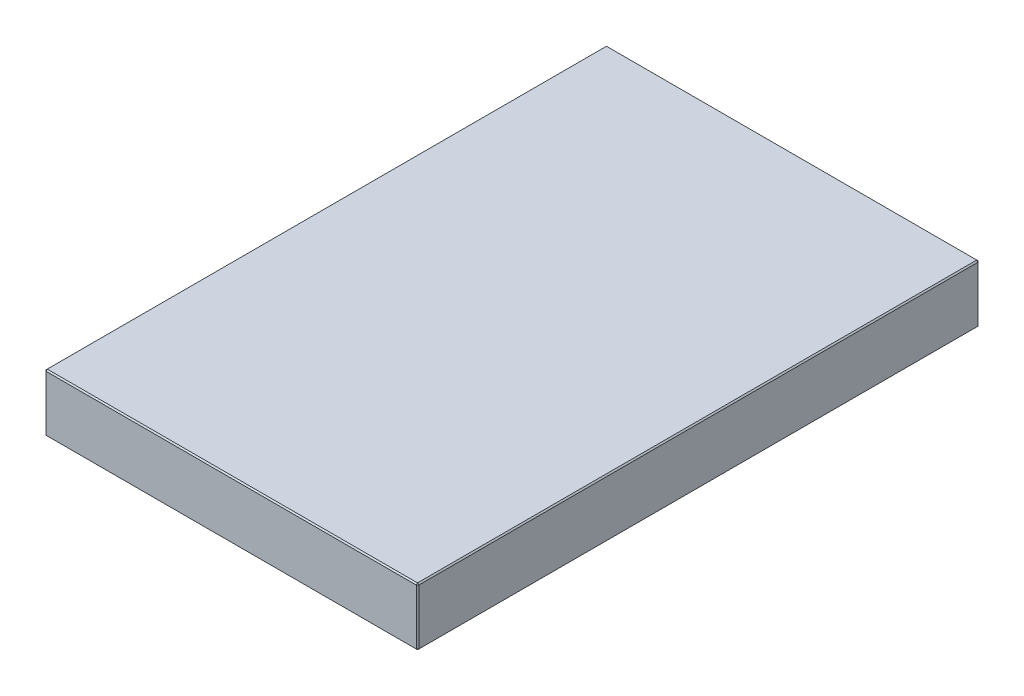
ISO-10303-21;
HEADER;
FILE_DESCRIPTION(('STEP AP214'),'2;1');
FILE_NAME('part.step','',(''),(''),'','','');
FILE_SCHEMA(('AUTOMOTIVE_DESIGN { 1 0 10303 214 1 1 1 1 }'));
ENDSEC;
DATA;
#1=APPLICATION_CONTEXT('core data for automotive mechanical design processes');
#2=APPLICATION_PROTOCOL_DEFINITION('international standard','automotive_design',2000,#1);
#3=PRODUCT_CONTEXT('',#1,'mechanical');
#4=PRODUCT('Part','Part','',(#3));
#5=PRODUCT_RELATED_PRODUCT_CATEGORY('part','',(#4));
#6=PRODUCT_DEFINITION_FORMATION('','',#4);
#7=PRODUCT_DEFINITION_CONTEXT('part definition',#1,'design');
#8=PRODUCT_DEFINITION('design','',#6,#7);
#9=PRODUCT_DEFINITION_SHAPE('','',#8);
#10=(LENGTH_UNIT() NAMED_UNIT(*) SI_UNIT(.MILLI.,.METRE.));
#11=(NAMED_UNIT(*) PLANE_ANGLE_UNIT() SI_UNIT($,.RADIAN.));
#12=(NAMED_UNIT(*) SI_UNIT($,.STERADIAN.) SOLID_ANGLE_UNIT());
#13=UNCERTAINTY_MEASURE_WITH_UNIT(LENGTH_MEASURE(1.E-05),#10,'distance_accuracy_value','');
#14=(GEOMETRIC_REPRESENTATION_CONTEXT(3) GLOBAL_UNCERTAINTY_ASSIGNED_CONTEXT((#13)) GLOBAL_UNIT_ASSIGNED_CONTEXT((#10,
#11,#12)) REPRESENTATION_CONTEXT('',''));
#15=CARTESIAN_POINT('',(0.,0.,0.));
#16=DIRECTION('',(0.,0.,1.));
#17=DIRECTION('',(1.,0.,0.));
#18=AXIS2_PLACEMENT_3D('',#15,#16,#17);
#19=CARTESIAN_POINT('',(-148.,46.,223.));
#20=DIRECTION('',(1.,0.,0.));
#21=DIRECTION('',(0.,0.,-1.));
#22=AXIS2_PLACEMENT_3D('',#19,#20,#21);
#23=PLANE('',#22);
#24=DIRECTION('',(0.,-1.,0.));
#25=VECTOR('',#24,1.);
#26=CARTESIAN_POINT('',(-148.,46.,-222.));
#27=LINE('',#26,#25);
#28=CARTESIAN_POINT('',(-148.,45.,-222.));
#29=VERTEX_POINT('',#28);
#30=CARTESIAN_POINT('',(-148.,1.,-222.));
#31=VERTEX_POINT('',#30);
#32=EDGE_CURVE('E114',#29,#31,#27,.T.);
#33=ORIENTED_EDGE('',*,*,#32,.T.);
#34=DIRECTION('',(0.,0.,1.));
#35=VECTOR('',#34,1.);
#36=CARTESIAN_POINT('',(-148.,1.,223.));
#37=LINE('',#36,#35);
#38=CARTESIAN_POINT('',(-148.,1.,222.));
#39=VERTEX_POINT('',#38);
#40=EDGE_CURVE('E110',#31,#39,#37,.T.);
#41=ORIENTED_EDGE('',*,*,#40,.T.);
#42=DIRECTION('',(0.,1.,0.));
#43=VECTOR('',#42,1.);
#44=CARTESIAN_POINT('',(-148.,46.,222.));
#45=LINE('',#44,#43);
#46=CARTESIAN_POINT('',(-148.,45.,222.));
#47=VERTEX_POINT('',#46);
#48=EDGE_CURVE('E103',#39,#47,#45,.T.);
#49=ORIENTED_EDGE('',*,*,#48,.T.);
#50=DIRECTION('',(0.,0.,-1.));
#51=VECTOR('',#50,1.);
#52=CARTESIAN_POINT('',(-148.,45.,-223.));
#53=LINE('',#52,#51);
#54=EDGE_CURVE('E107',#47,#29,#53,.T.);
#55=ORIENTED_EDGE('',*,*,#54,.T.);
#56=EDGE_LOOP('',(#33,#41,#49,#55));
#57=FACE_BOUND('',#56,.T.);
#58=ADVANCED_FACE('F15',(#57),#23,.F.);
#59=CARTESIAN_POINT('',(148.,46.,223.));
#60=DIRECTION('',(0.,0.,-1.));
#61=DIRECTION('',(-1.,0.,0.));
#62=AXIS2_PLACEMENT_3D('',#59,#60,#61);
#63=PLANE('',#62);
#64=DIRECTION('',(-1.,0.,0.));
#65=VECTOR('',#64,1.);
#66=CARTESIAN_POINT('',(-148.,45.,223.));
#67=LINE('',#66,#65);
#68=CARTESIAN_POINT('',(147.,45.,223.));
#69=VERTEX_POINT('',#68);
#70=CARTESIAN_POINT('',(-147.,45.,223.));
#71=VERTEX_POINT('',#70);
#72=EDGE_CURVE('E164',#69,#71,#67,.T.);
#73=ORIENTED_EDGE('',*,*,#72,.T.);
#74=DIRECTION('',(0.,-1.,0.));
#75=VECTOR('',#74,1.);
#76=CARTESIAN_POINT('',(-147.,46.,223.));
#77=LINE('',#76,#75);
#78=CARTESIAN_POINT('',(-147.,0.999999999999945,223.));
#79=VERTEX_POINT('',#78);
#80=EDGE_CURVE('E122',#71,#79,#77,.T.);
#81=ORIENTED_EDGE('',*,*,#80,.T.);
#82=DIRECTION('',(1.,0.,0.));
#83=VECTOR('',#82,1.);
#84=CARTESIAN_POINT('',(148.,0.999999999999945,223.));
#85=LINE('',#84,#83);
#86=CARTESIAN_POINT('',(147.,0.999999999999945,223.));
#87=VERTEX_POINT('',#86);
#88=EDGE_CURVE('E168',#79,#87,#85,.T.);
#89=ORIENTED_EDGE('',*,*,#88,.T.);
#90=DIRECTION('',(0.,1.,0.));
#91=VECTOR('',#90,1.);
#92=CARTESIAN_POINT('',(147.,46.,223.));
#93=LINE('',#92,#91);
#94=EDGE_CURVE('E166',#87,#69,#93,.T.);
#95=ORIENTED_EDGE('',*,*,#94,.T.);
#96=EDGE_LOOP('',(#73,#81,#89,#95));
#97=FACE_BOUND('',#96,.T.);
#98=ADVANCED_FACE('F275',(#97),#63,.F.);
#99=CARTESIAN_POINT('',(148.,46.,223.));
#100=DIRECTION('',(-1.,0.,0.));
#101=DIRECTION('',(0.,0.,1.));
#102=AXIS2_PLACEMENT_3D('',#99,#100,#101);
#103=PLANE('',#102);
#104=DIRECTION('',(0.,0.,-1.));
#105=VECTOR('',#104,1.);
#106=CARTESIAN_POINT('',(148.,0.999999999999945,223.));
#107=LINE('',#106,#105);
#108=CARTESIAN_POINT('',(148.,0.999999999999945,222.));
#109=VERTEX_POINT('',#108);
#110=CARTESIAN_POINT('',(148.,0.999999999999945,-222.));
#111=VERTEX_POINT('',#110);
#112=EDGE_CURVE('E159',#109,#111,#107,.T.);
#113=ORIENTED_EDGE('',*,*,#112,.T.);
#114=DIRECTION('',(0.,1.,0.));
#115=VECTOR('',#114,1.);
#116=CARTESIAN_POINT('',(148.,46.,-222.));
#117=LINE('',#116,#115);
#118=CARTESIAN_POINT('',(148.,45.,-222.));
#119=VERTEX_POINT('',#118);
#120=EDGE_CURVE('E161',#111,#119,#117,.T.);
#121=ORIENTED_EDGE('',*,*,#120,.T.);
#122=DIRECTION('',(0.,0.,1.));
#123=VECTOR('',#122,1.);
#124=CARTESIAN_POINT('',(148.,45.,223.));
#125=LINE('',#124,#123);
#126=CARTESIAN_POINT('',(148.,45.,222.));
#127=VERTEX_POINT('',#126);
#128=EDGE_CURVE('E155',#119,#127,#125,.T.);
#129=ORIENTED_EDGE('',*,*,#128,.T.);
#130=DIRECTION('',(0.,-1.,0.));
#131=VECTOR('',#130,1.);
#132=CARTESIAN_POINT('',(148.,46.,222.));
#133=LINE('',#132,#131);
#134=EDGE_CURVE('E157',#127,#109,#133,.T.);
#135=ORIENTED_EDGE('',*,*,#134,.T.);
#136=EDGE_LOOP('',(#113,#121,#129,#135));
#137=FACE_BOUND('',#136,.T.);
#138=ADVANCED_FACE('F254',(#137),#103,.F.);
#139=CARTESIAN_POINT('',(148.,46.,-223.));
#140=DIRECTION('',(0.,0.,1.));
#141=DIRECTION('',(1.,0.,0.));
#142=AXIS2_PLACEMENT_3D('',#139,#140,#141);
#143=PLANE('',#142);
#144=DIRECTION('',(0.,-1.,0.));
#145=VECTOR('',#144,1.);
#146=CARTESIAN_POINT('',(147.,46.,-223.));
#147=LINE('',#146,#145);
#148=CARTESIAN_POINT('',(147.,45.,-223.));
#149=VERTEX_POINT('',#148);
#150=CARTESIAN_POINT('',(147.,0.999999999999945,-223.));
#151=VERTEX_POINT('',#150);
#152=EDGE_CURVE('E148',#149,#151,#147,.T.);
#153=ORIENTED_EDGE('',*,*,#152,.T.);
#154=DIRECTION('',(-1.,0.,0.));
#155=VECTOR('',#154,1.);
#156=CARTESIAN_POINT('',(148.,0.999999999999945,-223.));
#157=LINE('',#156,#155);
#158=CARTESIAN_POINT('',(-147.,0.999999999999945,-223.));
#159=VERTEX_POINT('',#158);
#160=EDGE_CURVE('E153',#151,#159,#157,.T.);
#161=ORIENTED_EDGE('',*,*,#160,.T.);
#162=DIRECTION('',(0.,1.,0.));
#163=VECTOR('',#162,1.);
#164=CARTESIAN_POINT('',(-147.,46.,-223.));
#165=LINE('',#164,#163);
#166=CARTESIAN_POINT('',(-147.,45.,-223.));
#167=VERTEX_POINT('',#166);
#168=EDGE_CURVE('E150',#159,#167,#165,.T.);
#169=ORIENTED_EDGE('',*,*,#168,.T.);
#170=DIRECTION('',(1.,0.,0.));
#171=VECTOR('',#170,1.);
#172=CARTESIAN_POINT('',(148.,45.,-223.));
#173=LINE('',#172,#171);
#174=EDGE_CURVE('E146',#167,#149,#173,.T.);
#175=ORIENTED_EDGE('',*,*,#174,.T.);
#176=EDGE_LOOP('',(#153,#161,#169,#175));
#177=FACE_BOUND('',#176,.T.);
#178=ADVANCED_FACE('F284',(#177),#143,.F.);
#179=CARTESIAN_POINT('',(0.,46.,0.));
#180=DIRECTION('',(0.,1.,0.));
#181=DIRECTION('',(0.,0.,1.));
#182=AXIS2_PLACEMENT_3D('',#179,#180,#181);
#183=PLANE('',#182);
#184=DIRECTION('',(0.,0.,-1.));
#185=VECTOR('',#184,1.);
#186=CARTESIAN_POINT('',(147.,46.,-223.));
#187=LINE('',#186,#185);
#188=CARTESIAN_POINT('',(147.,46.,222.));
#189=VERTEX_POINT('',#188);
#190=CARTESIAN_POINT('',(147.,46.,-222.));
#191=VERTEX_POINT('',#190);
#192=EDGE_CURVE('E24',#189,#191,#187,.T.);
#193=ORIENTED_EDGE('',*,*,#192,.T.);
#194=DIRECTION('',(-1.,0.,0.));
#195=VECTOR('',#194,1.);
#196=CARTESIAN_POINT('',(-148.,46.,-222.));
#197=LINE('',#196,#195);
#198=CARTESIAN_POINT('',(-147.,46.,-222.));
#199=VERTEX_POINT('',#198);
#200=EDGE_CURVE('E9',#191,#199,#197,.T.);
#201=ORIENTED_EDGE('',*,*,#200,.T.);
#202=DIRECTION('',(0.,0.,1.));
#203=VECTOR('',#202,1.);
#204=CARTESIAN_POINT('',(-147.,46.,223.));
#205=LINE('',#204,#203);
#206=CARTESIAN_POINT('',(-147.,46.,222.));
#207=VERTEX_POINT('',#206);
#208=EDGE_CURVE('E180',#199,#207,#205,.T.);
#209=ORIENTED_EDGE('',*,*,#208,.T.);
#210=DIRECTION('',(1.,0.,0.));
#211=VECTOR('',#210,1.);
#212=CARTESIAN_POINT('',(148.,46.,222.));
#213=LINE('',#212,#211);
#214=EDGE_CURVE('E35',#207,#189,#213,.T.);
#215=ORIENTED_EDGE('',*,*,#214,.T.);
#216=EDGE_LOOP('',(#193,#201,#209,#215));
#217=FACE_BOUND('',#216,.T.);
#218=ADVANCED_FACE('F350',(#217),#183,.T.);
#219=CARTESIAN_POINT('',(0.,0.,0.));
#220=DIRECTION('',(0.,1.,0.));
#221=DIRECTION('',(0.,0.,1.));
#222=AXIS2_PLACEMENT_3D('',#219,#220,#221);
#223=PLANE('',#222);
#224=DIRECTION('',(0.,0.,1.));
#225=VECTOR('',#224,1.);
#226=CARTESIAN_POINT('',(147.,0.,0.));
#227=LINE('',#226,#225);
#228=CARTESIAN_POINT('',(147.,0.,-222.));
#229=VERTEX_POINT('',#228);
#230=CARTESIAN_POINT('',(147.,0.,222.));
#231=VERTEX_POINT('',#230);
#232=EDGE_CURVE('E171',#229,#231,#227,.T.);
#233=ORIENTED_EDGE('',*,*,#232,.T.);
#234=DIRECTION('',(-1.,0.,0.));
#235=VECTOR('',#234,1.);
#236=CARTESIAN_POINT('',(0.,0.,222.));
#237=LINE('',#236,#235);
#238=CARTESIAN_POINT('',(-147.,0.,222.));
#239=VERTEX_POINT('',#238);
#240=EDGE_CURVE('E177',#231,#239,#237,.T.);
#241=ORIENTED_EDGE('',*,*,#240,.T.);
#242=DIRECTION('',(0.,0.,-1.));
#243=VECTOR('',#242,1.);
#244=CARTESIAN_POINT('',(-147.,0.,0.));
#245=LINE('',#244,#243);
#246=CARTESIAN_POINT('',(-147.,0.,-222.));
#247=VERTEX_POINT('',#246);
#248=EDGE_CURVE('E175',#239,#247,#245,.T.);
#249=ORIENTED_EDGE('',*,*,#248,.T.);
#250=DIRECTION('',(1.,0.,0.));
#251=VECTOR('',#250,1.);
#252=CARTESIAN_POINT('',(0.,0.,-222.));
#253=LINE('',#252,#251);
#254=EDGE_CURVE('E173',#247,#229,#253,.T.);
#255=ORIENTED_EDGE('',*,*,#254,.T.);
#256=EDGE_LOOP('',(#233,#241,#249,#255));
#257=FACE_BOUND('',#256,.T.);
#258=ADVANCED_FACE('F246',(#257),#223,.F.);
#259=CARTESIAN_POINT('',(148.,46.,222.));
#260=DIRECTION('',(-0.707106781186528,0.,-0.707106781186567));
#261=DIRECTION('',(0.,-1.,0.));
#262=AXIS2_PLACEMENT_3D('',#259,#260,#261);
#263=PLANE('',#262);
#264=DIRECTION('',(-0.707106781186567,0.,0.707106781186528));
#265=VECTOR('',#264,1.);
#266=CARTESIAN_POINT('',(147.,45.,223.));
#267=LINE('',#266,#265);
#268=EDGE_CURVE('E19',#69,#127,#267,.F.);
#269=ORIENTED_EDGE('',*,*,#268,.F.);
#270=ORIENTED_EDGE('',*,*,#94,.F.);
#271=DIRECTION('',(0.707106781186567,0.,-0.707106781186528));
#272=VECTOR('',#271,1.);
#273=CARTESIAN_POINT('',(147.,0.999999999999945,223.));
#274=LINE('',#273,#272);
#275=EDGE_CURVE('E142',#109,#87,#274,.F.);
#276=ORIENTED_EDGE('',*,*,#275,.F.);
#277=ORIENTED_EDGE('',*,*,#134,.F.);
#278=EDGE_LOOP('',(#269,#270,#276,#277));
#279=FACE_BOUND('',#278,.T.);
#280=ADVANCED_FACE('F17',(#279),#263,.F.);
#281=CARTESIAN_POINT('',(147.,45.,223.));
#282=DIRECTION('',(0.577350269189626,0.577350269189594,0.577350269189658));
#283=DIRECTION('',(0.707106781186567,0.,-0.707106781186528));
#284=AXIS2_PLACEMENT_3D('',#281,#282,#283);
#285=PLANE('',#284);
#286=DIRECTION('',(0.,-0.707106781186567,0.707106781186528));
#287=VECTOR('',#286,1.);
#288=CARTESIAN_POINT('',(147.,45.,223.));
#289=LINE('',#288,#287);
#290=EDGE_CURVE('E226',#69,#189,#289,.F.);
#291=ORIENTED_EDGE('',*,*,#290,.F.);
#292=ORIENTED_EDGE('',*,*,#268,.T.);
#293=DIRECTION('',(-0.707106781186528,0.707106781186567,0.));
#294=VECTOR('',#293,1.);
#295=CARTESIAN_POINT('',(147.5,45.5,222.));
#296=LINE('',#295,#294);
#297=EDGE_CURVE('E228',#189,#127,#296,.F.);
#298=ORIENTED_EDGE('',*,*,#297,.F.);
#299=EDGE_LOOP('',(#291,#292,#298));
#300=FACE_BOUND('',#299,.T.);
#301=ADVANCED_FACE('F270',(#300),#285,.T.);
#302=CARTESIAN_POINT('',(147.,0.999999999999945,223.));
#303=DIRECTION('',(0.577350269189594,-0.577350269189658,0.577350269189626));
#304=DIRECTION('',(0.,-0.707106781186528,-0.707106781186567));
#305=AXIS2_PLACEMENT_3D('',#302,#303,#304);
#306=PLANE('',#305);
#307=DIRECTION('',(-0.707106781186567,-0.707106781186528,0.));
#308=VECTOR('',#307,1.);
#309=CARTESIAN_POINT('',(147.5,0.499999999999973,222.));
#310=LINE('',#309,#308);
#311=EDGE_CURVE('E220',#109,#231,#310,.T.);
#312=ORIENTED_EDGE('',*,*,#311,.F.);
#313=ORIENTED_EDGE('',*,*,#275,.T.);
#314=DIRECTION('',(0.,0.707106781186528,0.707106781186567));
#315=VECTOR('',#314,1.);
#316=CARTESIAN_POINT('',(147.,0.999999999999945,223.));
#317=LINE('',#316,#315);
#318=EDGE_CURVE('E223',#231,#87,#317,.T.);
#319=ORIENTED_EDGE('',*,*,#318,.F.);
#320=EDGE_LOOP('',(#312,#313,#319));
#321=FACE_BOUND('',#320,.T.);
#322=ADVANCED_FACE('F235',(#321),#306,.T.);
#323=CARTESIAN_POINT('',(147.,46.,0.));
#324=DIRECTION('',(0.707106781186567,0.707106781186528,0.));
#325=DIRECTION('',(0.,0.,1.));
#326=AXIS2_PLACEMENT_3D('',#323,#324,#325);
#327=PLANE('',#326);
#328=ORIENTED_EDGE('',*,*,#297,.T.);
#329=ORIENTED_EDGE('',*,*,#128,.F.);
#330=DIRECTION('',(0.707106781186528,-0.707106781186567,0.));
#331=VECTOR('',#330,1.);
#332=CARTESIAN_POINT('',(148.,45.,-222.));
#333=LINE('',#332,#331);
#334=EDGE_CURVE('E215',#191,#119,#333,.T.);
#335=ORIENTED_EDGE('',*,*,#334,.F.);
#336=ORIENTED_EDGE('',*,*,#192,.F.);
#337=EDGE_LOOP('',(#328,#329,#335,#336));
#338=FACE_BOUND('',#337,.T.);
#339=ADVANCED_FACE('F265',(#338),#327,.T.);
#340=CARTESIAN_POINT('',(0.,46.,222.));
#341=DIRECTION('',(0.,0.707106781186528,0.707106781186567));
#342=DIRECTION('',(-1.,0.,0.));
#343=AXIS2_PLACEMENT_3D('',#340,#341,#342);
#344=PLANE('',#343);
#345=ORIENTED_EDGE('',*,*,#290,.T.);
#346=ORIENTED_EDGE('',*,*,#214,.F.);
#347=DIRECTION('',(0.,0.707106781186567,-0.707106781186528));
#348=VECTOR('',#347,1.);
#349=CARTESIAN_POINT('',(-147.,45.5,222.5));
#350=LINE('',#349,#348);
#351=EDGE_CURVE('E126',#71,#207,#350,.T.);
#352=ORIENTED_EDGE('',*,*,#351,.F.);
#353=ORIENTED_EDGE('',*,*,#72,.F.);
#354=EDGE_LOOP('',(#345,#346,#352,#353));
#355=FACE_BOUND('',#354,.T.);
#356=ADVANCED_FACE('F273',(#355),#344,.T.);
#357=CARTESIAN_POINT('',(-147.,46.,223.));
#358=DIRECTION('',(0.707106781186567,0.,-0.707106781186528));
#359=DIRECTION('',(0.,-1.,0.));
#360=AXIS2_PLACEMENT_3D('',#357,#358,#359);
#361=PLANE('',#360);
#362=DIRECTION('',(0.707106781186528,0.,0.707106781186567));
#363=VECTOR('',#362,1.);
#364=CARTESIAN_POINT('',(-147.,0.999999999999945,223.));
#365=LINE('',#364,#363);
#366=EDGE_CURVE('E127',#79,#39,#365,.F.);
#367=ORIENTED_EDGE('',*,*,#366,.F.);
#368=ORIENTED_EDGE('',*,*,#80,.F.);
#369=DIRECTION('',(-0.707106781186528,0.,-0.707106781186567));
#370=VECTOR('',#369,1.);
#371=CARTESIAN_POINT('',(-148.,45.,222.));
#372=LINE('',#371,#370);
#373=EDGE_CURVE('E118',#47,#71,#372,.F.);
#374=ORIENTED_EDGE('',*,*,#373,.F.);
#375=ORIENTED_EDGE('',*,*,#48,.F.);
#376=EDGE_LOOP('',(#367,#368,#374,#375));
#377=FACE_BOUND('',#376,.T.);
#378=ADVANCED_FACE('F120',(#377),#361,.F.);
#379=CARTESIAN_POINT('',(148.,0.999999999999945,223.));
#380=DIRECTION('',(0.,0.707106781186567,-0.707106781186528));
#381=DIRECTION('',(1.,0.,0.));
#382=AXIS2_PLACEMENT_3D('',#379,#380,#381);
#383=PLANE('',#382);
#384=ORIENTED_EDGE('',*,*,#318,.T.);
#385=ORIENTED_EDGE('',*,*,#88,.F.);
#386=DIRECTION('',(0.,-0.707106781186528,-0.707106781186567));
#387=VECTOR('',#386,1.);
#388=CARTESIAN_POINT('',(-147.,0.999999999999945,223.));
#389=LINE('',#388,#387);
#390=EDGE_CURVE('E211',#239,#79,#389,.F.);
#391=ORIENTED_EDGE('',*,*,#390,.F.);
#392=ORIENTED_EDGE('',*,*,#240,.F.);
#393=EDGE_LOOP('',(#384,#385,#391,#392));
#394=FACE_BOUND('',#393,.T.);
#395=ADVANCED_FACE('F243',(#394),#383,.F.);
#396=CARTESIAN_POINT('',(148.,0.999999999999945,223.));
#397=DIRECTION('',(-0.707106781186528,0.707106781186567,0.));
#398=DIRECTION('',(0.,0.,-1.));
#399=AXIS2_PLACEMENT_3D('',#396,#397,#398);
#400=PLANE('',#399);
#401=ORIENTED_EDGE('',*,*,#311,.T.);
#402=ORIENTED_EDGE('',*,*,#232,.F.);
#403=DIRECTION('',(0.707106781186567,0.707106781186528,0.));
#404=VECTOR('',#403,1.);
#405=CARTESIAN_POINT('',(147.5,0.499999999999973,-222.));
#406=LINE('',#405,#404);
#407=EDGE_CURVE('E208',#111,#229,#406,.F.);
#408=ORIENTED_EDGE('',*,*,#407,.F.);
#409=ORIENTED_EDGE('',*,*,#112,.F.);
#410=EDGE_LOOP('',(#401,#402,#408,#409));
#411=FACE_BOUND('',#410,.T.);
#412=ADVANCED_FACE('F251',(#411),#400,.F.);
#413=CARTESIAN_POINT('',(147.,46.,-223.));
#414=DIRECTION('',(-0.707106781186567,0.,0.707106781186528));
#415=DIRECTION('',(0.,-1.,0.));
#416=AXIS2_PLACEMENT_3D('',#413,#414,#415);
#417=PLANE('',#416);
#418=DIRECTION('',(0.707106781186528,0.,0.707106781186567));
#419=VECTOR('',#418,1.);
#420=CARTESIAN_POINT('',(148.,45.,-222.));
#421=LINE('',#420,#419);
#422=EDGE_CURVE('E217',#119,#149,#421,.F.);
#423=ORIENTED_EDGE('',*,*,#422,.F.);
#424=ORIENTED_EDGE('',*,*,#120,.F.);
#425=DIRECTION('',(-0.707106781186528,0.,-0.707106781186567));
#426=VECTOR('',#425,1.);
#427=CARTESIAN_POINT('',(147.,0.999999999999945,-223.));
#428=LINE('',#427,#426);
#429=EDGE_CURVE('E205',#151,#111,#428,.F.);
#430=ORIENTED_EDGE('',*,*,#429,.F.);
#431=ORIENTED_EDGE('',*,*,#152,.F.);
#432=EDGE_LOOP('',(#423,#424,#430,#431));
#433=FACE_BOUND('',#432,.T.);
#434=ADVANCED_FACE('F258',(#433),#417,.F.);
#435=CARTESIAN_POINT('',(148.,45.,-222.));
#436=DIRECTION('',(0.577350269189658,0.577350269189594,-0.577350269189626));
#437=DIRECTION('',(-0.707106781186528,0.,-0.707106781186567));
#438=AXIS2_PLACEMENT_3D('',#435,#436,#437);
#439=PLANE('',#438);
#440=ORIENTED_EDGE('',*,*,#334,.T.);
#441=ORIENTED_EDGE('',*,*,#422,.T.);
#442=DIRECTION('',(0.,0.707106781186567,0.707106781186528));
#443=VECTOR('',#442,1.);
#444=CARTESIAN_POINT('',(147.,45.5,-222.5));
#445=LINE('',#444,#443);
#446=EDGE_CURVE('E134',#191,#149,#445,.F.);
#447=ORIENTED_EDGE('',*,*,#446,.F.);
#448=EDGE_LOOP('',(#440,#441,#447));
#449=FACE_BOUND('',#448,.T.);
#450=ADVANCED_FACE('F325',(#449),#439,.T.);
#451=CARTESIAN_POINT('',(-148.,45.,222.));
#452=DIRECTION('',(-0.577350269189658,0.577350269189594,0.577350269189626));
#453=DIRECTION('',(0.707106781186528,0.,0.707106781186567));
#454=AXIS2_PLACEMENT_3D('',#451,#452,#453);
#455=PLANE('',#454);
#456=ORIENTED_EDGE('',*,*,#373,.T.);
#457=ORIENTED_EDGE('',*,*,#351,.T.);
#458=DIRECTION('',(-0.707106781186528,-0.707106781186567,0.));
#459=VECTOR('',#458,1.);
#460=CARTESIAN_POINT('',(-148.,45.,222.));
#461=LINE('',#460,#459);
#462=EDGE_CURVE('E130',#47,#207,#461,.F.);
#463=ORIENTED_EDGE('',*,*,#462,.F.);
#464=EDGE_LOOP('',(#456,#457,#463));
#465=FACE_BOUND('',#464,.T.);
#466=ADVANCED_FACE('F131',(#465),#455,.T.);
#467=CARTESIAN_POINT('',(-147.,0.999999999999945,223.));
#468=DIRECTION('',(-0.577350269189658,-0.577350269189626,0.577350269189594));
#469=DIRECTION('',(0.707106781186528,-0.707106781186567,0.));
#470=AXIS2_PLACEMENT_3D('',#467,#468,#469);
#471=PLANE('',#470);
#472=ORIENTED_EDGE('',*,*,#390,.T.);
#473=ORIENTED_EDGE('',*,*,#366,.T.);
#474=DIRECTION('',(-0.707106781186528,0.707106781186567,0.));
#475=VECTOR('',#474,1.);
#476=CARTESIAN_POINT('',(-147.5,0.5,222.));
#477=LINE('',#476,#475);
#478=EDGE_CURVE('E135',#239,#39,#477,.T.);
#479=ORIENTED_EDGE('',*,*,#478,.F.);
#480=EDGE_LOOP('',(#472,#473,#479));
#481=FACE_BOUND('',#480,.T.);
#482=ADVANCED_FACE('F318',(#481),#471,.T.);
#483=CARTESIAN_POINT('',(147.,0.999999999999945,-223.));
#484=DIRECTION('',(0.577350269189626,-0.577350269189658,-0.577350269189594));
#485=DIRECTION('',(0.707106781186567,0.707106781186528,0.));
#486=AXIS2_PLACEMENT_3D('',#483,#484,#485);
#487=PLANE('',#486);
#488=ORIENTED_EDGE('',*,*,#429,.T.);
#489=ORIENTED_EDGE('',*,*,#407,.T.);
#490=DIRECTION('',(0.,-0.707106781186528,0.707106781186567));
#491=VECTOR('',#490,1.);
#492=CARTESIAN_POINT('',(147.,0.999999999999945,-223.));
#493=LINE('',#492,#491);
#494=EDGE_CURVE('E198',#151,#229,#493,.T.);
#495=ORIENTED_EDGE('',*,*,#494,.F.);
#496=EDGE_LOOP('',(#488,#489,#495));
#497=FACE_BOUND('',#496,.T.);
#498=ADVANCED_FACE('F314',(#497),#487,.T.);
#499=CARTESIAN_POINT('',(0.,46.,-222.));
#500=DIRECTION('',(0.,0.707106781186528,-0.707106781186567));
#501=DIRECTION('',(1.,0.,0.));
#502=AXIS2_PLACEMENT_3D('',#499,#500,#501);
#503=PLANE('',#502);
#504=ORIENTED_EDGE('',*,*,#446,.T.);
#505=ORIENTED_EDGE('',*,*,#174,.F.);
#506=DIRECTION('',(0.,-0.707106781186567,-0.707106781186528));
#507=VECTOR('',#506,1.);
#508=CARTESIAN_POINT('',(-147.,45.,-223.));
#509=LINE('',#508,#507);
#510=EDGE_CURVE('E195',#199,#167,#509,.T.);
#511=ORIENTED_EDGE('',*,*,#510,.F.);
#512=ORIENTED_EDGE('',*,*,#200,.F.);
#513=EDGE_LOOP('',(#504,#505,#511,#512));
#514=FACE_BOUND('',#513,.T.);
#515=ADVANCED_FACE('F311',(#514),#503,.T.);
#516=CARTESIAN_POINT('',(-147.,46.,0.));
#517=DIRECTION('',(-0.707106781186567,0.707106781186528,0.));
#518=DIRECTION('',(0.,0.,-1.));
#519=AXIS2_PLACEMENT_3D('',#516,#517,#518);
#520=PLANE('',#519);
#521=ORIENTED_EDGE('',*,*,#462,.T.);
#522=ORIENTED_EDGE('',*,*,#208,.F.);
#523=DIRECTION('',(0.707106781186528,0.707106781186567,0.));
#524=VECTOR('',#523,1.);
#525=CARTESIAN_POINT('',(-147.5,45.5,-222.));
#526=LINE('',#525,#524);
#527=EDGE_CURVE('E138',#29,#199,#526,.T.);
#528=ORIENTED_EDGE('',*,*,#527,.F.);
#529=ORIENTED_EDGE('',*,*,#54,.F.);
#530=EDGE_LOOP('',(#521,#522,#528,#529));
#531=FACE_BOUND('',#530,.T.);
#532=ADVANCED_FACE('F137',(#531),#520,.T.);
#533=CARTESIAN_POINT('',(-148.,1.,223.));
#534=DIRECTION('',(0.707106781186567,0.707106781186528,0.));
#535=DIRECTION('',(0.,0.,1.));
#536=AXIS2_PLACEMENT_3D('',#533,#534,#535);
#537=PLANE('',#536);
#538=ORIENTED_EDGE('',*,*,#478,.T.);
#539=ORIENTED_EDGE('',*,*,#40,.F.);
#540=DIRECTION('',(0.707106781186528,-0.707106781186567,0.));
#541=VECTOR('',#540,1.);
#542=CARTESIAN_POINT('',(-148.,1.,-222.));
#543=LINE('',#542,#541);
#544=EDGE_CURVE('E191',#247,#31,#543,.F.);
#545=ORIENTED_EDGE('',*,*,#544,.F.);
#546=ORIENTED_EDGE('',*,*,#248,.F.);
#547=EDGE_LOOP('',(#538,#539,#545,#546));
#548=FACE_BOUND('',#547,.T.);
#549=ADVANCED_FACE('F304',(#548),#537,.F.);
#550=CARTESIAN_POINT('',(148.,0.999999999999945,-223.));
#551=DIRECTION('',(0.,0.707106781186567,0.707106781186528));
#552=DIRECTION('',(-1.,0.,0.));
#553=AXIS2_PLACEMENT_3D('',#550,#551,#552);
#554=PLANE('',#553);
#555=ORIENTED_EDGE('',*,*,#494,.T.);
#556=ORIENTED_EDGE('',*,*,#254,.F.);
#557=DIRECTION('',(0.,0.707106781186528,-0.707106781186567));
#558=VECTOR('',#557,1.);
#559=CARTESIAN_POINT('',(-147.,0.499999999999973,-222.5));
#560=LINE('',#559,#558);
#561=EDGE_CURVE('E188',#159,#247,#560,.F.);
#562=ORIENTED_EDGE('',*,*,#561,.F.);
#563=ORIENTED_EDGE('',*,*,#160,.F.);
#564=EDGE_LOOP('',(#555,#556,#562,#563));
#565=FACE_BOUND('',#564,.T.);
#566=ADVANCED_FACE('F300',(#565),#554,.F.);
#567=CARTESIAN_POINT('',(-147.,45.,-223.));
#568=DIRECTION('',(-0.577350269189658,0.577350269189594,-0.577350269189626));
#569=DIRECTION('',(-0.707106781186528,0.,0.707106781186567));
#570=AXIS2_PLACEMENT_3D('',#567,#568,#569);
#571=PLANE('',#570);
#572=ORIENTED_EDGE('',*,*,#527,.T.);
#573=ORIENTED_EDGE('',*,*,#510,.T.);
#574=DIRECTION('',(0.707106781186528,0.,-0.707106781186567));
#575=VECTOR('',#574,1.);
#576=CARTESIAN_POINT('',(-147.,45.,-223.));
#577=LINE('',#576,#575);
#578=EDGE_CURVE('E186',#29,#167,#577,.T.);
#579=ORIENTED_EDGE('',*,*,#578,.F.);
#580=EDGE_LOOP('',(#572,#573,#579));
#581=FACE_BOUND('',#580,.T.);
#582=ADVANCED_FACE('F296',(#581),#571,.T.);
#583=CARTESIAN_POINT('',(-148.,1.,-222.));
#584=DIRECTION('',(-0.577350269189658,-0.577350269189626,-0.577350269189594));
#585=DIRECTION('',(0.707106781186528,-0.707106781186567,0.));
#586=AXIS2_PLACEMENT_3D('',#583,#584,#585);
#587=PLANE('',#586);
#588=ORIENTED_EDGE('',*,*,#561,.T.);
#589=ORIENTED_EDGE('',*,*,#544,.T.);
#590=DIRECTION('',(-0.707106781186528,0.,0.707106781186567));
#591=VECTOR('',#590,1.);
#592=CARTESIAN_POINT('',(-148.,1.,-222.));
#593=LINE('',#592,#591);
#594=EDGE_CURVE('E184',#159,#31,#593,.T.);
#595=ORIENTED_EDGE('',*,*,#594,.F.);
#596=EDGE_LOOP('',(#588,#589,#595));
#597=FACE_BOUND('',#596,.T.);
#598=ADVANCED_FACE('F292',(#597),#587,.T.);
#599=CARTESIAN_POINT('',(-148.,46.,-222.));
#600=DIRECTION('',(0.707106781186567,0.,0.707106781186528));
#601=DIRECTION('',(0.,-1.,0.));
#602=AXIS2_PLACEMENT_3D('',#599,#600,#601);
#603=PLANE('',#602);
#604=ORIENTED_EDGE('',*,*,#578,.T.);
#605=ORIENTED_EDGE('',*,*,#168,.F.);
#606=ORIENTED_EDGE('',*,*,#594,.T.);
#607=ORIENTED_EDGE('',*,*,#32,.F.);
#608=EDGE_LOOP('',(#604,#605,#606,#607));
#609=FACE_BOUND('',#608,.T.);
#610=ADVANCED_FACE('F289',(#609),#603,.F.);
#611=CLOSED_SHELL('',(#58,#98,#138,#178,#218,#258,#280,#301,#322,#339,#356,#378,#395,#412,#434,
#450,#466,#482,#498,#515,#532,#549,#566,#582,#598,#610));
#612=MANIFOLD_SOLID_BREP('B1',#611);
#613=ADVANCED_BREP_SHAPE_REPRESENTATION('',(#18,#612),#14);
#614=SHAPE_DEFINITION_REPRESENTATION(#9,#613);
ENDSEC;
END-ISO-10303-21;
